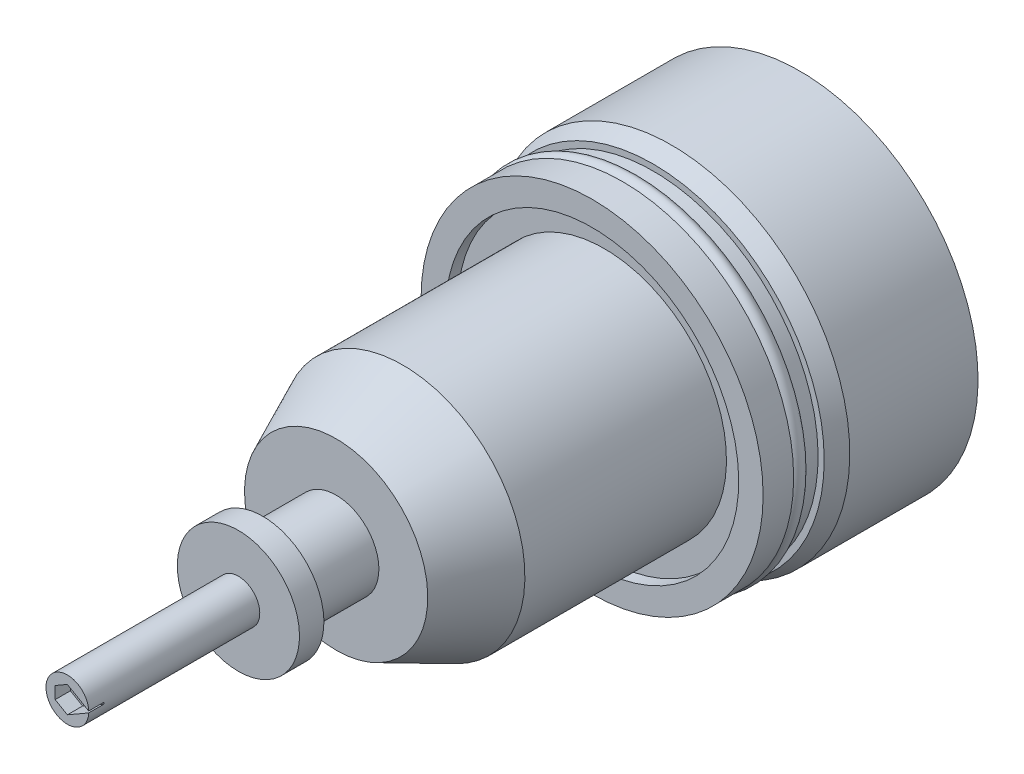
ISO-10303-21;
HEADER;
FILE_DESCRIPTION(('STEP AP214'),'2;1');
FILE_NAME('part.step','',(''),(''),'','','');
FILE_SCHEMA(('AUTOMOTIVE_DESIGN { 1 0 10303 214 1 1 1 1 }'));
ENDSEC;
DATA;
#1=APPLICATION_CONTEXT('core data for automotive mechanical design processes');
#2=APPLICATION_PROTOCOL_DEFINITION('international standard','automotive_design',2000,#1);
#3=PRODUCT_CONTEXT('',#1,'mechanical');
#4=PRODUCT('Part','Part','',(#3));
#5=PRODUCT_RELATED_PRODUCT_CATEGORY('part','',(#4));
#6=PRODUCT_DEFINITION_FORMATION('','',#4);
#7=PRODUCT_DEFINITION_CONTEXT('part definition',#1,'design');
#8=PRODUCT_DEFINITION('design','',#6,#7);
#9=PRODUCT_DEFINITION_SHAPE('','',#8);
#10=(LENGTH_UNIT() NAMED_UNIT(*) SI_UNIT(.MILLI.,.METRE.));
#11=(NAMED_UNIT(*) PLANE_ANGLE_UNIT() SI_UNIT($,.RADIAN.));
#12=(NAMED_UNIT(*) SI_UNIT($,.STERADIAN.) SOLID_ANGLE_UNIT());
#13=UNCERTAINTY_MEASURE_WITH_UNIT(LENGTH_MEASURE(1.E-05),#10,'distance_accuracy_value','');
#14=(GEOMETRIC_REPRESENTATION_CONTEXT(3) GLOBAL_UNCERTAINTY_ASSIGNED_CONTEXT((#13)) GLOBAL_UNIT_ASSIGNED_CONTEXT((#10,
#11,#12)) REPRESENTATION_CONTEXT('',''));
#15=CARTESIAN_POINT('',(0.,0.,0.));
#16=DIRECTION('',(0.,0.,1.));
#17=DIRECTION('',(1.,0.,0.));
#18=AXIS2_PLACEMENT_3D('',#15,#16,#17);
#19=CARTESIAN_POINT('',(0.,0.,32.2487632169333));
#20=DIRECTION('',(0.,0.,1.));
#21=DIRECTION('',(0.,-1.,0.));
#22=AXIS2_PLACEMENT_3D('',#19,#20,#21);
#23=CYLINDRICAL_SURFACE('',#22,29.1862155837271);
#24=CARTESIAN_POINT('',(0.,0.,63.1880436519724));
#25=DIRECTION('',(0.,0.,1.));
#26=DIRECTION('',(0.,-1.,0.));
#27=AXIS2_PLACEMENT_3D('',#24,#25,#26);
#28=CIRCLE('',#27,29.1862155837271);
#29=CARTESIAN_POINT('',(0.,-29.1862155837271,63.1880436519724));
#30=VERTEX_POINT('',#29);
#31=EDGE_CURVE('E222',#30,#30,#28,.F.);
#32=ORIENTED_EDGE('',*,*,#31,.T.);
#33=EDGE_LOOP('',(#32));
#34=FACE_BOUND('',#33,.T.);
#35=CARTESIAN_POINT('',(0.,0.,42.1880436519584));
#36=DIRECTION('',(0.,0.,1.));
#37=DIRECTION('',(0.,-1.,0.));
#38=AXIS2_PLACEMENT_3D('',#35,#36,#37);
#39=CIRCLE('',#38,29.1862155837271);
#40=CARTESIAN_POINT('',(0.,-29.1862155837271,42.1880436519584));
#41=VERTEX_POINT('',#40);
#42=EDGE_CURVE('E640',#41,#41,#39,.T.);
#43=ORIENTED_EDGE('',*,*,#42,.T.);
#44=EDGE_LOOP('',(#43));
#45=FACE_BOUND('',#44,.T.);
#46=ADVANCED_FACE('F48',(#34,#45),#23,.T.);
#47=CARTESIAN_POINT('',(0.,0.,66.1880436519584));
#48=DIRECTION('',(0.,0.,1.));
#49=DIRECTION('',(0.,-1.,0.));
#50=AXIS2_PLACEMENT_3D('',#47,#48,#49);
#51=PLANE('',#50);
#52=CARTESIAN_POINT('',(0.,0.,66.1880436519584));
#53=DIRECTION('',(0.,0.,1.));
#54=DIRECTION('',(0.,-1.,0.));
#55=AXIS2_PLACEMENT_3D('',#52,#53,#54);
#56=CIRCLE('',#55,27.9999999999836);
#57=CARTESIAN_POINT('',(0.,-27.9999999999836,66.1880436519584));
#58=VERTEX_POINT('',#57);
#59=EDGE_CURVE('E226',#58,#58,#56,.T.);
#60=ORIENTED_EDGE('',*,*,#59,.T.);
#61=EDGE_LOOP('',(#60));
#62=FACE_BOUND('',#61,.T.);
#63=CARTESIAN_POINT('',(0.,0.,66.1880436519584));
#64=DIRECTION('',(0.,0.,1.));
#65=DIRECTION('',(0.,-1.,0.));
#66=AXIS2_PLACEMENT_3D('',#63,#64,#65);
#67=CIRCLE('',#66,27.);
#68=CARTESIAN_POINT('',(0.,-27.,66.1880436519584));
#69=VERTEX_POINT('',#68);
#70=EDGE_CURVE('E165',#69,#69,#67,.T.);
#71=ORIENTED_EDGE('',*,*,#70,.F.);
#72=EDGE_LOOP('',(#71));
#73=FACE_BOUND('',#72,.T.);
#74=ADVANCED_FACE('F378',(#62,#73),#51,.T.);
#75=CARTESIAN_POINT('',(0.,0.,32.2487632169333));
#76=DIRECTION('',(0.,0.,1.));
#77=DIRECTION('',(0.,-1.,0.));
#78=AXIS2_PLACEMENT_3D('',#75,#76,#77);
#79=CYLINDRICAL_SURFACE('',#78,27.);
#80=CARTESIAN_POINT('',(0.,0.,68.6880436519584));
#81=DIRECTION('',(0.,0.,1.));
#82=DIRECTION('',(0.,1.,0.));
#83=AXIS2_PLACEMENT_3D('',#80,#81,#82);
#84=CIRCLE('',#83,27.);
#85=CARTESIAN_POINT('',(0.,27.,68.6880436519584));
#86=VERTEX_POINT('',#85);
#87=EDGE_CURVE('E318',#86,#86,#84,.T.);
#88=ORIENTED_EDGE('',*,*,#87,.F.);
#89=EDGE_LOOP('',(#88));
#90=FACE_BOUND('',#89,.T.);
#91=ORIENTED_EDGE('',*,*,#70,.T.);
#92=EDGE_LOOP('',(#91));
#93=FACE_BOUND('',#92,.T.);
#94=ADVANCED_FACE('F391',(#90,#93),#79,.T.);
#95=CARTESIAN_POINT('',(0.,0.,134.096755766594));
#96=DIRECTION('',(0.,0.,1.));
#97=DIRECTION('',(0.,-1.,0.));
#98=AXIS2_PLACEMENT_3D('',#95,#96,#97);
#99=CYLINDRICAL_SURFACE('',#98,3.5);
#100=CARTESIAN_POINT('',(0.,0.,134.096755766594));
#101=DIRECTION('',(0.,0.,1.));
#102=DIRECTION('',(0.,-1.,0.));
#103=AXIS2_PLACEMENT_3D('',#100,#101,#102);
#104=CIRCLE('',#103,3.5);
#105=CARTESIAN_POINT('',(0.,-3.49999999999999,134.096755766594));
#106=VERTEX_POINT('',#105);
#107=EDGE_CURVE('E315',#106,#106,#104,.F.);
#108=ORIENTED_EDGE('',*,*,#107,.F.);
#109=EDGE_LOOP('',(#108));
#110=FACE_BOUND('',#109,.T.);
#111=CARTESIAN_POINT('',(0.,0.,162.096755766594));
#112=DIRECTION('',(0.,0.,1.));
#113=DIRECTION('',(1.,0.,0.));
#114=AXIS2_PLACEMENT_3D('',#111,#112,#113);
#115=CIRCLE('',#114,3.5);
#116=CARTESIAN_POINT('',(3.49737654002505,0.135489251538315,162.096755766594));
#117=VERTEX_POINT('',#116);
#118=CARTESIAN_POINT('',(3.49737654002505,-0.1354892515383,162.096755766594));
#119=VERTEX_POINT('',#118);
#120=EDGE_CURVE('E155',#117,#119,#115,.T.);
#121=ORIENTED_EDGE('',*,*,#120,.F.);
#122=DIRECTION('',(0.,0.,1.));
#123=VECTOR('',#122,1.);
#124=CARTESIAN_POINT('',(3.49737654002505,0.135489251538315,159.596755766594));
#125=LINE('',#124,#123);
#126=CARTESIAN_POINT('',(3.49737654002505,0.135489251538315,159.596755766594));
#127=VERTEX_POINT('',#126);
#128=EDGE_CURVE('E160',#127,#117,#125,.T.);
#129=ORIENTED_EDGE('',*,*,#128,.F.);
#130=CARTESIAN_POINT('',(0.,0.,159.596755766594));
#131=DIRECTION('',(0.,0.,1.));
#132=DIRECTION('',(1.,0.,0.));
#133=AXIS2_PLACEMENT_3D('',#130,#131,#132);
#134=CIRCLE('',#133,3.5);
#135=CARTESIAN_POINT('',(3.49737654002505,-0.1354892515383,159.596755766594));
#136=VERTEX_POINT('',#135);
#137=EDGE_CURVE('E124',#136,#127,#134,.T.);
#138=ORIENTED_EDGE('',*,*,#137,.F.);
#139=DIRECTION('',(0.,0.,1.));
#140=VECTOR('',#139,1.);
#141=CARTESIAN_POINT('',(3.49737654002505,-0.1354892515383,159.596755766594));
#142=LINE('',#141,#140);
#143=EDGE_CURVE('E114',#136,#119,#142,.T.);
#144=ORIENTED_EDGE('',*,*,#143,.T.);
#145=EDGE_LOOP('',(#121,#129,#138,#144));
#146=FACE_BOUND('',#145,.T.);
#147=ADVANCED_FACE('F203',(#110,#146),#99,.T.);
#148=CARTESIAN_POINT('',(0.,0.,69.9380436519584));
#149=DIRECTION('',(0.,0.,1.));
#150=DIRECTION('',(0.,1.,0.));
#151=AXIS2_PLACEMENT_3D('',#148,#149,#150);
#152=TOROIDAL_SURFACE('',#151,27.,1.25000000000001);
#153=CARTESIAN_POINT('',(0.,0.,71.1880436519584));
#154=DIRECTION('',(0.,0.,-1.));
#155=DIRECTION('',(0.,1.,0.));
#156=AXIS2_PLACEMENT_3D('',#153,#154,#155);
#157=CIRCLE('',#156,27.);
#158=CARTESIAN_POINT('',(0.,27.,71.1880436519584));
#159=VERTEX_POINT('',#158);
#160=CARTESIAN_POINT('',(0.,-27.,71.1880436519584));
#161=VERTEX_POINT('',#160);
#162=EDGE_CURVE('E70',#159,#161,#157,.T.);
#163=ORIENTED_EDGE('',*,*,#162,.T.);
#164=CARTESIAN_POINT('',(0.,0.,71.1880436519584));
#165=DIRECTION('',(0.,0.,-1.));
#166=DIRECTION('',(0.,-1.,0.));
#167=AXIS2_PLACEMENT_3D('',#164,#165,#166);
#168=CIRCLE('',#167,27.);
#169=EDGE_CURVE('E314',#161,#159,#168,.T.);
#170=ORIENTED_EDGE('',*,*,#169,.T.);
#171=EDGE_LOOP('',(#163,#170));
#172=FACE_BOUND('',#171,.T.);
#173=ORIENTED_EDGE('',*,*,#87,.T.);
#174=EDGE_LOOP('',(#173));
#175=FACE_BOUND('',#174,.T.);
#176=ADVANCED_FACE('F199',(#172,#175),#152,.T.);
#177=CARTESIAN_POINT('',(0.,0.,134.096755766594));
#178=DIRECTION('',(0.,0.,1.));
#179=DIRECTION('',(0.,-1.,0.));
#180=AXIS2_PLACEMENT_3D('',#177,#178,#179);
#181=PLANE('',#180);
#182=ORIENTED_EDGE('',*,*,#107,.T.);
#183=EDGE_LOOP('',(#182));
#184=FACE_BOUND('',#183,.T.);
#185=CARTESIAN_POINT('',(0.,0.,134.096755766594));
#186=DIRECTION('',(0.,0.,1.));
#187=DIRECTION('',(0.,-1.,0.));
#188=AXIS2_PLACEMENT_3D('',#185,#186,#187);
#189=CIRCLE('',#188,10.);
#190=CARTESIAN_POINT('',(0.,-9.99999999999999,134.096755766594));
#191=VERTEX_POINT('',#190);
#192=EDGE_CURVE('E310',#191,#191,#189,.F.);
#193=ORIENTED_EDGE('',*,*,#192,.F.);
#194=EDGE_LOOP('',(#193));
#195=FACE_BOUND('',#194,.T.);
#196=ADVANCED_FACE('F184',(#184,#195),#181,.T.);
#197=CARTESIAN_POINT('',(0.,0.,71.1880436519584));
#198=DIRECTION('',(0.,0.,1.));
#199=DIRECTION('',(0.,-1.,0.));
#200=AXIS2_PLACEMENT_3D('',#197,#198,#199);
#201=PLANE('',#200);
#202=ORIENTED_EDGE('',*,*,#162,.F.);
#203=ORIENTED_EDGE('',*,*,#169,.F.);
#204=EDGE_LOOP('',(#202,#203));
#205=FACE_BOUND('',#204,.T.);
#206=CARTESIAN_POINT('',(0.,0.,71.1880436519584));
#207=DIRECTION('',(0.,0.,1.));
#208=DIRECTION('',(0.,-1.,0.));
#209=AXIS2_PLACEMENT_3D('',#206,#207,#208);
#210=CIRCLE('',#209,28.);
#211=CARTESIAN_POINT('',(0.,-28.,71.1880436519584));
#212=VERTEX_POINT('',#211);
#213=EDGE_CURVE('E289',#212,#212,#210,.T.);
#214=ORIENTED_EDGE('',*,*,#213,.F.);
#215=EDGE_LOOP('',(#214));
#216=FACE_BOUND('',#215,.T.);
#217=ADVANCED_FACE('F173',(#205,#216),#201,.F.);
#218=CARTESIAN_POINT('',(0.,0.,130.096755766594));
#219=DIRECTION('',(0.,0.,1.));
#220=DIRECTION('',(0.,-1.,0.));
#221=AXIS2_PLACEMENT_3D('',#218,#219,#220);
#222=CYLINDRICAL_SURFACE('',#221,10.);
#223=ORIENTED_EDGE('',*,*,#192,.T.);
#224=EDGE_LOOP('',(#223));
#225=FACE_BOUND('',#224,.T.);
#226=CARTESIAN_POINT('',(0.,0.,130.096755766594));
#227=DIRECTION('',(0.,0.,1.));
#228=DIRECTION('',(0.,-1.,0.));
#229=AXIS2_PLACEMENT_3D('',#226,#227,#228);
#230=CIRCLE('',#229,10.);
#231=CARTESIAN_POINT('',(0.,-9.99999999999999,130.096755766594));
#232=VERTEX_POINT('',#231);
#233=EDGE_CURVE('E296',#232,#232,#230,.T.);
#234=ORIENTED_EDGE('',*,*,#233,.T.);
#235=EDGE_LOOP('',(#234));
#236=FACE_BOUND('',#235,.T.);
#237=ADVANCED_FACE('F183',(#225,#236),#222,.T.);
#238=CARTESIAN_POINT('',(0.,0.,32.2487632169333));
#239=DIRECTION('',(0.,0.,1.));
#240=DIRECTION('',(0.,-1.,0.));
#241=AXIS2_PLACEMENT_3D('',#238,#239,#240);
#242=CYLINDRICAL_SURFACE('',#241,28.);
#243=ORIENTED_EDGE('',*,*,#213,.T.);
#244=EDGE_LOOP('',(#243));
#245=FACE_BOUND('',#244,.T.);
#246=CARTESIAN_POINT('',(0.,0.,76.1880436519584));
#247=DIRECTION('',(0.,0.,1.));
#248=DIRECTION('',(0.,-1.,0.));
#249=AXIS2_PLACEMENT_3D('',#246,#247,#248);
#250=CIRCLE('',#249,28.);
#251=CARTESIAN_POINT('',(0.,-28.,76.1880436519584));
#252=VERTEX_POINT('',#251);
#253=EDGE_CURVE('E292',#252,#252,#250,.T.);
#254=ORIENTED_EDGE('',*,*,#253,.F.);
#255=EDGE_LOOP('',(#254));
#256=FACE_BOUND('',#255,.T.);
#257=ADVANCED_FACE('F278',(#245,#256),#242,.T.);
#258=CARTESIAN_POINT('',(0.,0.,130.096755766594));
#259=DIRECTION('',(0.,0.,1.));
#260=DIRECTION('',(0.,-1.,0.));
#261=AXIS2_PLACEMENT_3D('',#258,#259,#260);
#262=PLANE('',#261);
#263=CARTESIAN_POINT('',(0.,0.,130.096755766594));
#264=DIRECTION('',(0.,0.,1.));
#265=DIRECTION('',(0.,-1.,0.));
#266=AXIS2_PLACEMENT_3D('',#263,#264,#265);
#267=CIRCLE('',#266,7.);
#268=CARTESIAN_POINT('',(0.,-6.99999999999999,130.096755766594));
#269=VERTEX_POINT('',#268);
#270=EDGE_CURVE('E295',#269,#269,#267,.F.);
#271=ORIENTED_EDGE('',*,*,#270,.F.);
#272=EDGE_LOOP('',(#271));
#273=FACE_BOUND('',#272,.T.);
#274=ORIENTED_EDGE('',*,*,#233,.F.);
#275=EDGE_LOOP('',(#274));
#276=FACE_BOUND('',#275,.T.);
#277=ADVANCED_FACE('F275',(#273,#276),#262,.F.);
#278=CARTESIAN_POINT('',(0.,0.,76.1880436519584));
#279=DIRECTION('',(0.,0.,1.));
#280=DIRECTION('',(0.,-1.,0.));
#281=AXIS2_PLACEMENT_3D('',#278,#279,#280);
#282=PLANE('',#281);
#283=CARTESIAN_POINT('',(0.,0.,76.1880436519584));
#284=DIRECTION('',(0.,0.,1.));
#285=DIRECTION('',(0.,-1.,0.));
#286=AXIS2_PLACEMENT_3D('',#283,#284,#285);
#287=CIRCLE('',#286,24.);
#288=CARTESIAN_POINT('',(0.,-24.,76.1880436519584));
#289=VERTEX_POINT('',#288);
#290=EDGE_CURVE('E302',#289,#289,#287,.F.);
#291=ORIENTED_EDGE('',*,*,#290,.T.);
#292=EDGE_LOOP('',(#291));
#293=FACE_BOUND('',#292,.T.);
#294=ORIENTED_EDGE('',*,*,#253,.T.);
#295=EDGE_LOOP('',(#294));
#296=FACE_BOUND('',#295,.T.);
#297=ADVANCED_FACE('F271',(#293,#296),#282,.T.);
#298=CARTESIAN_POINT('',(0.,0.,118.096755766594));
#299=DIRECTION('',(0.,0.,1.));
#300=DIRECTION('',(0.,-1.,0.));
#301=AXIS2_PLACEMENT_3D('',#298,#299,#300);
#302=CYLINDRICAL_SURFACE('',#301,7.);
#303=CARTESIAN_POINT('',(0.,0.,118.096755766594));
#304=DIRECTION('',(0.,0.,1.));
#305=DIRECTION('',(0.,-1.,0.));
#306=AXIS2_PLACEMENT_3D('',#303,#304,#305);
#307=CIRCLE('',#306,7.);
#308=CARTESIAN_POINT('',(0.,-6.99999999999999,118.096755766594));
#309=VERTEX_POINT('',#308);
#310=EDGE_CURVE('E338',#309,#309,#307,.F.);
#311=ORIENTED_EDGE('',*,*,#310,.F.);
#312=EDGE_LOOP('',(#311));
#313=FACE_BOUND('',#312,.T.);
#314=ORIENTED_EDGE('',*,*,#270,.T.);
#315=EDGE_LOOP('',(#314));
#316=FACE_BOUND('',#315,.T.);
#317=ADVANCED_FACE('F267',(#313,#316),#302,.T.);
#318=CARTESIAN_POINT('',(0.,0.,32.2487632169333));
#319=DIRECTION('',(0.,0.,1.));
#320=DIRECTION('',(0.,-1.,0.));
#321=AXIS2_PLACEMENT_3D('',#318,#319,#320);
#322=CYLINDRICAL_SURFACE('',#321,24.);
#323=ORIENTED_EDGE('',*,*,#290,.F.);
#324=EDGE_LOOP('',(#323));
#325=FACE_BOUND('',#324,.T.);
#326=CARTESIAN_POINT('',(0.,0.,74.1880436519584));
#327=DIRECTION('',(0.,0.,1.));
#328=DIRECTION('',(0.,-1.,0.));
#329=AXIS2_PLACEMENT_3D('',#326,#327,#328);
#330=CIRCLE('',#329,24.);
#331=CARTESIAN_POINT('',(0.,-24.,74.1880436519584));
#332=VERTEX_POINT('',#331);
#333=EDGE_CURVE('E334',#332,#332,#330,.T.);
#334=ORIENTED_EDGE('',*,*,#333,.F.);
#335=EDGE_LOOP('',(#334));
#336=FACE_BOUND('',#335,.T.);
#337=ADVANCED_FACE('F264',(#325,#336),#322,.F.);
#338=CARTESIAN_POINT('',(0.,0.,118.096755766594));
#339=DIRECTION('',(0.,0.,1.));
#340=DIRECTION('',(0.,-1.,0.));
#341=AXIS2_PLACEMENT_3D('',#338,#339,#340);
#342=PLANE('',#341);
#343=CARTESIAN_POINT('',(0.,0.,118.096755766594));
#344=DIRECTION('',(0.,0.,1.));
#345=DIRECTION('',(0.,-1.,0.));
#346=AXIS2_PLACEMENT_3D('',#343,#344,#345);
#347=CIRCLE('',#346,15.0000000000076);
#348=CARTESIAN_POINT('',(0.,-15.0000000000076,118.096755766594));
#349=VERTEX_POINT('',#348);
#350=EDGE_CURVE('E56',#349,#349,#347,.T.);
#351=ORIENTED_EDGE('',*,*,#350,.T.);
#352=EDGE_LOOP('',(#351));
#353=FACE_BOUND('',#352,.T.);
#354=ORIENTED_EDGE('',*,*,#310,.T.);
#355=EDGE_LOOP('',(#354));
#356=FACE_BOUND('',#355,.T.);
#357=ADVANCED_FACE('F231',(#353,#356),#342,.T.);
#358=CARTESIAN_POINT('',(0.,0.,74.1880436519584));
#359=DIRECTION('',(0.,0.,1.));
#360=DIRECTION('',(0.,-1.,0.));
#361=AXIS2_PLACEMENT_3D('',#358,#359,#360);
#362=PLANE('',#361);
#363=CARTESIAN_POINT('',(0.,0.,74.1880436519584));
#364=DIRECTION('',(0.,0.,1.));
#365=DIRECTION('',(0.,-1.,0.));
#366=AXIS2_PLACEMENT_3D('',#363,#364,#365);
#367=CIRCLE('',#366,20.);
#368=CARTESIAN_POINT('',(0.,-20.,74.1880436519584));
#369=VERTEX_POINT('',#368);
#370=EDGE_CURVE('E223',#369,#369,#367,.T.);
#371=ORIENTED_EDGE('',*,*,#370,.F.);
#372=EDGE_LOOP('',(#371));
#373=FACE_BOUND('',#372,.T.);
#374=ORIENTED_EDGE('',*,*,#333,.T.);
#375=EDGE_LOOP('',(#374));
#376=FACE_BOUND('',#375,.T.);
#377=ADVANCED_FACE('F249',(#373,#376),#362,.T.);
#378=CARTESIAN_POINT('',(0.,0.,32.2487632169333));
#379=DIRECTION('',(0.,0.,1.));
#380=DIRECTION('',(0.,-1.,0.));
#381=AXIS2_PLACEMENT_3D('',#378,#379,#380);
#382=CYLINDRICAL_SURFACE('',#381,20.);
#383=CARTESIAN_POINT('',(0.,0.,107.18804365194));
#384=DIRECTION('',(0.,0.,1.));
#385=DIRECTION('',(0.,-1.,0.));
#386=AXIS2_PLACEMENT_3D('',#383,#384,#385);
#387=CIRCLE('',#386,20.);
#388=CARTESIAN_POINT('',(0.,-20.,107.18804365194));
#389=VERTEX_POINT('',#388);
#390=EDGE_CURVE('E13',#389,#389,#387,.F.);
#391=ORIENTED_EDGE('',*,*,#390,.T.);
#392=EDGE_LOOP('',(#391));
#393=FACE_BOUND('',#392,.T.);
#394=ORIENTED_EDGE('',*,*,#370,.T.);
#395=EDGE_LOOP('',(#394));
#396=FACE_BOUND('',#395,.T.);
#397=ADVANCED_FACE('F245',(#393,#396),#382,.T.);
#398=CARTESIAN_POINT('',(0.,0.,63.1880436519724));
#399=DIRECTION('',(0.,0.,-1.));
#400=DIRECTION('',(0.,1.,0.));
#401=AXIS2_PLACEMENT_3D('',#398,#399,#400);
#402=CONICAL_SURFACE('',#401,29.1862155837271,0.376539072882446);
#403=ORIENTED_EDGE('',*,*,#59,.F.);
#404=EDGE_LOOP('',(#403));
#405=FACE_BOUND('',#404,.T.);
#406=ORIENTED_EDGE('',*,*,#31,.F.);
#407=EDGE_LOOP('',(#406));
#408=FACE_BOUND('',#407,.T.);
#409=ADVANCED_FACE('F236',(#405,#408),#402,.T.);
#410=CARTESIAN_POINT('',(0.,0.,118.096755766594));
#411=DIRECTION('',(0.,0.,-1.));
#412=DIRECTION('',(0.,1.,0.));
#413=AXIS2_PLACEMENT_3D('',#410,#411,#412);
#414=CONICAL_SURFACE('',#413,15.0000000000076,0.429775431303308);
#415=ORIENTED_EDGE('',*,*,#390,.F.);
#416=EDGE_LOOP('',(#415));
#417=FACE_BOUND('',#416,.T.);
#418=ORIENTED_EDGE('',*,*,#350,.F.);
#419=EDGE_LOOP('',(#418));
#420=FACE_BOUND('',#419,.T.);
#421=ADVANCED_FACE('F50',(#417,#420),#414,.T.);
#422=CARTESIAN_POINT('',(0.,0.,36.3367628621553));
#423=DIRECTION('',(0.,0.,-1.));
#424=DIRECTION('',(0.,1.,0.));
#425=AXIS2_PLACEMENT_3D('',#422,#423,#424);
#426=PLANE('',#425);
#427=CARTESIAN_POINT('',(0.,0.,36.3367628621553));
#428=DIRECTION('',(0.,0.,-1.));
#429=DIRECTION('',(0.,1.,0.));
#430=AXIS2_PLACEMENT_3D('',#427,#428,#429);
#431=CIRCLE('',#430,16.0207867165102);
#432=CARTESIAN_POINT('',(0.,16.0207867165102,36.3367628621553));
#433=VERTEX_POINT('',#432);
#434=EDGE_CURVE('E135',#433,#433,#431,.T.);
#435=ORIENTED_EDGE('',*,*,#434,.T.);
#436=EDGE_LOOP('',(#435));
#437=FACE_BOUND('',#436,.T.);
#438=ADVANCED_FACE('F235',(#437),#426,.T.);
#439=CARTESIAN_POINT('',(0.,0.,42.1880436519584));
#440=DIRECTION('',(0.,0.,1.));
#441=DIRECTION('',(0.,1.,0.));
#442=AXIS2_PLACEMENT_3D('',#439,#440,#441);
#443=CONICAL_SURFACE('',#442,22.1862155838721,0.811534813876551);
#444=ORIENTED_EDGE('',*,*,#434,.F.);
#445=EDGE_LOOP('',(#444));
#446=FACE_BOUND('',#445,.T.);
#447=CARTESIAN_POINT('',(0.,0.,42.1880436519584));
#448=DIRECTION('',(0.,0.,1.));
#449=DIRECTION('',(0.,-1.,0.));
#450=AXIS2_PLACEMENT_3D('',#447,#448,#449);
#451=CIRCLE('',#450,22.1862155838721);
#452=CARTESIAN_POINT('',(0.,-22.1862155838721,42.1880436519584));
#453=VERTEX_POINT('',#452);
#454=EDGE_CURVE('E214',#453,#453,#451,.F.);
#455=ORIENTED_EDGE('',*,*,#454,.T.);
#456=EDGE_LOOP('',(#455));
#457=FACE_BOUND('',#456,.T.);
#458=ADVANCED_FACE('F242',(#446,#457),#443,.T.);
#459=CARTESIAN_POINT('',(0.,0.,42.1880436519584));
#460=DIRECTION('',(0.,0.,1.));
#461=DIRECTION('',(0.,-1.,0.));
#462=AXIS2_PLACEMENT_3D('',#459,#460,#461);
#463=PLANE('',#462);
#464=ORIENTED_EDGE('',*,*,#454,.F.);
#465=EDGE_LOOP('',(#464));
#466=FACE_BOUND('',#465,.T.);
#467=ORIENTED_EDGE('',*,*,#42,.F.);
#468=EDGE_LOOP('',(#467));
#469=FACE_BOUND('',#468,.T.);
#470=ADVANCED_FACE('F353',(#466,#469),#463,.F.);
#471=CARTESIAN_POINT('',(0.,2.15470053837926,159.596755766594));
#472=DIRECTION('',(-0.5,0.866025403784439,0.));
#473=DIRECTION('',(-0.866025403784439,-0.5,0.));
#474=AXIS2_PLACEMENT_3D('',#471,#472,#473);
#475=PLANE('',#474);
#476=DIRECTION('',(-0.866025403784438,-0.5,0.));
#477=VECTOR('',#476,1.);
#478=CARTESIAN_POINT('',(0.,2.15470053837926,162.096755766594));
#479=LINE('',#478,#477);
#480=CARTESIAN_POINT('',(0.,2.15470053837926,162.096755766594));
#481=VERTEX_POINT('',#480);
#482=CARTESIAN_POINT('',(-2.,1.00000000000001,162.096755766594));
#483=VERTEX_POINT('',#482);
#484=EDGE_CURVE('E132',#481,#483,#479,.T.);
#485=ORIENTED_EDGE('',*,*,#484,.T.);
#486=DIRECTION('',(0.,0.,1.));
#487=VECTOR('',#486,1.);
#488=CARTESIAN_POINT('',(-2.,1.00000000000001,159.596755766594));
#489=LINE('',#488,#487);
#490=CARTESIAN_POINT('',(-2.,1.00000000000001,159.596755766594));
#491=VERTEX_POINT('',#490);
#492=EDGE_CURVE('E156',#491,#483,#489,.T.);
#493=ORIENTED_EDGE('',*,*,#492,.F.);
#494=DIRECTION('',(-0.866025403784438,-0.5,0.));
#495=VECTOR('',#494,1.);
#496=CARTESIAN_POINT('',(0.,2.15470053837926,159.596755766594));
#497=LINE('',#496,#495);
#498=CARTESIAN_POINT('',(0.,2.15470053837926,159.596755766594));
#499=VERTEX_POINT('',#498);
#500=EDGE_CURVE('E142',#499,#491,#497,.T.);
#501=ORIENTED_EDGE('',*,*,#500,.F.);
#502=DIRECTION('',(0.,0.,1.));
#503=VECTOR('',#502,1.);
#504=CARTESIAN_POINT('',(0.,2.15470053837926,159.596755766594));
#505=LINE('',#504,#503);
#506=EDGE_CURVE('E158',#499,#481,#505,.T.);
#507=ORIENTED_EDGE('',*,*,#506,.T.);
#508=EDGE_LOOP('',(#485,#493,#501,#507));
#509=FACE_BOUND('',#508,.T.);
#510=ADVANCED_FACE('F358',(#509),#475,.F.);
#511=CARTESIAN_POINT('',(-2.,1.00000000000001,159.596755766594));
#512=DIRECTION('',(-1.,0.,0.));
#513=DIRECTION('',(0.,-1.,0.));
#514=AXIS2_PLACEMENT_3D('',#511,#512,#513);
#515=PLANE('',#514);
#516=DIRECTION('',(0.,-1.,0.));
#517=VECTOR('',#516,1.);
#518=CARTESIAN_POINT('',(-2.,1.00000000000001,162.096755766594));
#519=LINE('',#518,#517);
#520=CARTESIAN_POINT('',(-2.,-0.99999999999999,162.096755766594));
#521=VERTEX_POINT('',#520);
#522=EDGE_CURVE('E129',#483,#521,#519,.T.);
#523=ORIENTED_EDGE('',*,*,#522,.T.);
#524=DIRECTION('',(0.,0.,1.));
#525=VECTOR('',#524,1.);
#526=CARTESIAN_POINT('',(-2.,-0.99999999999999,159.596755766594));
#527=LINE('',#526,#525);
#528=CARTESIAN_POINT('',(-2.,-0.99999999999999,159.596755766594));
#529=VERTEX_POINT('',#528);
#530=EDGE_CURVE('E153',#529,#521,#527,.T.);
#531=ORIENTED_EDGE('',*,*,#530,.F.);
#532=DIRECTION('',(0.,-1.,0.));
#533=VECTOR('',#532,1.);
#534=CARTESIAN_POINT('',(-2.,1.00000000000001,159.596755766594));
#535=LINE('',#534,#533);
#536=EDGE_CURVE('E115',#491,#529,#535,.T.);
#537=ORIENTED_EDGE('',*,*,#536,.F.);
#538=ORIENTED_EDGE('',*,*,#492,.T.);
#539=EDGE_LOOP('',(#523,#531,#537,#538));
#540=FACE_BOUND('',#539,.T.);
#541=ADVANCED_FACE('F600',(#540),#515,.F.);
#542=CARTESIAN_POINT('',(-2.,-0.99999999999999,159.596755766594));
#543=DIRECTION('',(-0.499999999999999,-0.866025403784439,0.));
#544=DIRECTION('',(0.866025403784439,-0.499999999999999,0.));
#545=AXIS2_PLACEMENT_3D('',#542,#543,#544);
#546=PLANE('',#545);
#547=DIRECTION('',(0.866025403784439,-0.499999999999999,0.));
#548=VECTOR('',#547,1.);
#549=CARTESIAN_POINT('',(-2.,-0.99999999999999,162.096755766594));
#550=LINE('',#549,#548);
#551=CARTESIAN_POINT('',(0.,-2.15470053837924,162.096755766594));
#552=VERTEX_POINT('',#551);
#553=EDGE_CURVE('E63',#521,#552,#550,.T.);
#554=ORIENTED_EDGE('',*,*,#553,.T.);
#555=DIRECTION('',(0.,0.,1.));
#556=VECTOR('',#555,1.);
#557=CARTESIAN_POINT('',(0.,-2.15470053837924,159.596755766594));
#558=LINE('',#557,#556);
#559=CARTESIAN_POINT('',(0.,-2.15470053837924,159.596755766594));
#560=VERTEX_POINT('',#559);
#561=EDGE_CURVE('E106',#560,#552,#558,.T.);
#562=ORIENTED_EDGE('',*,*,#561,.F.);
#563=DIRECTION('',(0.866025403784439,-0.499999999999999,0.));
#564=VECTOR('',#563,1.);
#565=CARTESIAN_POINT('',(-2.,-0.99999999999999,159.596755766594));
#566=LINE('',#565,#564);
#567=EDGE_CURVE('E110',#529,#560,#566,.T.);
#568=ORIENTED_EDGE('',*,*,#567,.F.);
#569=ORIENTED_EDGE('',*,*,#530,.T.);
#570=EDGE_LOOP('',(#554,#562,#568,#569));
#571=FACE_BOUND('',#570,.T.);
#572=ADVANCED_FACE('F108',(#571),#546,.F.);
#573=CARTESIAN_POINT('',(0.,-2.15470053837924,159.596755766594));
#574=DIRECTION('',(0.499999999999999,-0.866025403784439,0.));
#575=DIRECTION('',(0.866025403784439,0.499999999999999,0.));
#576=AXIS2_PLACEMENT_3D('',#573,#574,#575);
#577=PLANE('',#576);
#578=DIRECTION('',(0.866025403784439,0.499999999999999,0.));
#579=VECTOR('',#578,1.);
#580=CARTESIAN_POINT('',(0.,-2.15470053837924,162.096755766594));
#581=LINE('',#580,#579);
#582=EDGE_CURVE('E146',#552,#119,#581,.T.);
#583=ORIENTED_EDGE('',*,*,#582,.T.);
#584=ORIENTED_EDGE('',*,*,#143,.F.);
#585=DIRECTION('',(0.866025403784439,0.499999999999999,0.));
#586=VECTOR('',#585,1.);
#587=CARTESIAN_POINT('',(0.,-2.15470053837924,159.596755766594));
#588=LINE('',#587,#586);
#589=EDGE_CURVE('E118',#560,#136,#588,.T.);
#590=ORIENTED_EDGE('',*,*,#589,.F.);
#591=ORIENTED_EDGE('',*,*,#561,.T.);
#592=EDGE_LOOP('',(#583,#584,#590,#591));
#593=FACE_BOUND('',#592,.T.);
#594=ADVANCED_FACE('F119',(#593),#577,.F.);
#595=CARTESIAN_POINT('',(0.,0.,159.596755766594));
#596=DIRECTION('',(0.,0.,1.));
#597=DIRECTION('',(1.,0.,0.));
#598=AXIS2_PLACEMENT_3D('',#595,#596,#597);
#599=PLANE('',#598);
#600=ORIENTED_EDGE('',*,*,#567,.T.);
#601=ORIENTED_EDGE('',*,*,#589,.T.);
#602=ORIENTED_EDGE('',*,*,#137,.T.);
#603=DIRECTION('',(-0.866025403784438,0.500000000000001,0.));
#604=VECTOR('',#603,1.);
#605=CARTESIAN_POINT('',(3.49737654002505,0.135489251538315,159.596755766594));
#606=LINE('',#605,#604);
#607=EDGE_CURVE('E139',#127,#499,#606,.T.);
#608=ORIENTED_EDGE('',*,*,#607,.T.);
#609=ORIENTED_EDGE('',*,*,#500,.T.);
#610=ORIENTED_EDGE('',*,*,#536,.T.);
#611=EDGE_LOOP('',(#600,#601,#602,#608,#609,#610));
#612=FACE_BOUND('',#611,.T.);
#613=ADVANCED_FACE('F126',(#612),#599,.T.);
#614=CARTESIAN_POINT('',(3.49737654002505,0.135489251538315,159.596755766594));
#615=DIRECTION('',(0.500000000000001,0.866025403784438,0.));
#616=DIRECTION('',(-0.866025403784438,0.500000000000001,0.));
#617=AXIS2_PLACEMENT_3D('',#614,#615,#616);
#618=PLANE('',#617);
#619=DIRECTION('',(-0.866025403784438,0.500000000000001,0.));
#620=VECTOR('',#619,1.);
#621=CARTESIAN_POINT('',(3.49737654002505,0.135489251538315,162.096755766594));
#622=LINE('',#621,#620);
#623=EDGE_CURVE('E148',#117,#481,#622,.T.);
#624=ORIENTED_EDGE('',*,*,#623,.T.);
#625=ORIENTED_EDGE('',*,*,#506,.F.);
#626=ORIENTED_EDGE('',*,*,#607,.F.);
#627=ORIENTED_EDGE('',*,*,#128,.T.);
#628=EDGE_LOOP('',(#624,#625,#626,#627));
#629=FACE_BOUND('',#628,.T.);
#630=ADVANCED_FACE('F572',(#629),#618,.F.);
#631=CARTESIAN_POINT('',(0.,0.,162.096755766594));
#632=DIRECTION('',(0.,0.,1.));
#633=DIRECTION('',(1.,0.,0.));
#634=AXIS2_PLACEMENT_3D('',#631,#632,#633);
#635=PLANE('',#634);
#636=ORIENTED_EDGE('',*,*,#623,.F.);
#637=ORIENTED_EDGE('',*,*,#120,.T.);
#638=ORIENTED_EDGE('',*,*,#582,.F.);
#639=ORIENTED_EDGE('',*,*,#553,.F.);
#640=ORIENTED_EDGE('',*,*,#522,.F.);
#641=ORIENTED_EDGE('',*,*,#484,.F.);
#642=EDGE_LOOP('',(#636,#637,#638,#639,#640,#641));
#643=FACE_BOUND('',#642,.T.);
#644=ADVANCED_FACE('F259',(#643),#635,.T.);
#645=CLOSED_SHELL('',(#46,#74,#94,#147,#176,#196,#217,#237,#257,#277,#297,#317,#337,#357,#377,
#397,#409,#421,#438,#458,#470,#510,#541,#572,#594,#613,#630,#644));
#646=MANIFOLD_SOLID_BREP('B2',#645);
#647=ADVANCED_BREP_SHAPE_REPRESENTATION('',(#18,#646),#14);
#648=SHAPE_DEFINITION_REPRESENTATION(#9,#647);
ENDSEC;
END-ISO-10303-21;
